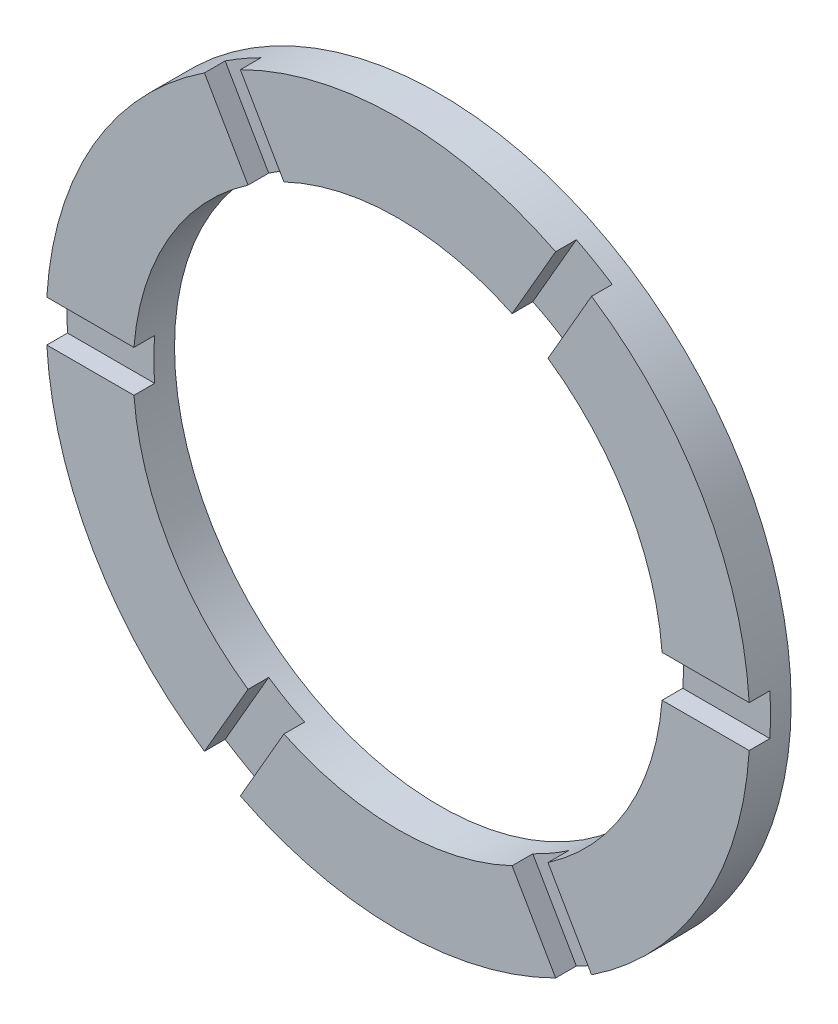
from build123d import *

# Parameters (mm, degrees)
ESQUISSE1_R                  = 4.25
ESQUISSE1_R_2                = 3.2
EXTRUSION1_DEPTH             = 0.5
ENL_V_START                  = -0.25
ENL_V_MAT_EXTRU_1_DEPTH      = 0.25
R_P_TITION_CIRCULAIRE1_COUNT = 6


with BuildPart() as part:
    # Esquisse1 → Extrusion1 (new body)
    with BuildSketch(Plane.XY):
        Circle(ESQUISSE1_R)
        Circle(ESQUISSE1_R_2, mode=Mode.SUBTRACT)
    extrude(amount=EXTRUSION1_DEPTH)

    # Esquisse2 → Enl_v. mat.-Extru.1 (cut)
    with BuildSketch(Plane.XY.offset(0.5).offset(ENL_V_START)):
        with BuildLine():
            Line((1.756379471, 2.541415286), (2.338129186, 3.549035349))
            ThreePointArc((2.338129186, 3.549035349), (2.125, 3.680607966), (1.904490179, 3.799396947))
            Line((1.904490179, 3.799396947), (1.322740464, 2.791776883))
            Line((1.322740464, 2.791776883), (1.756379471, 2.541415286))
        make_face()
    enl_v_mat_extru_1 = extrude(amount=ENL_V_MAT_EXTRU_1_DEPTH, mode=Mode.SUBTRACT)

    # R_p_tition circulaire1: Enl_v. mat.-Extru.1 ×6 about axis
    r_p_tition_circulaire1_axis = Axis((0, 0, 0), (0, 0, 1))
    for i in range(1, R_P_TITION_CIRCULAIRE1_COUNT):
        add(enl_v_mat_extru_1.rotate(r_p_tition_circulaire1_axis, i * 360 / R_P_TITION_CIRCULAIRE1_COUNT), mode=Mode.SUBTRACT)


solid = part.part
